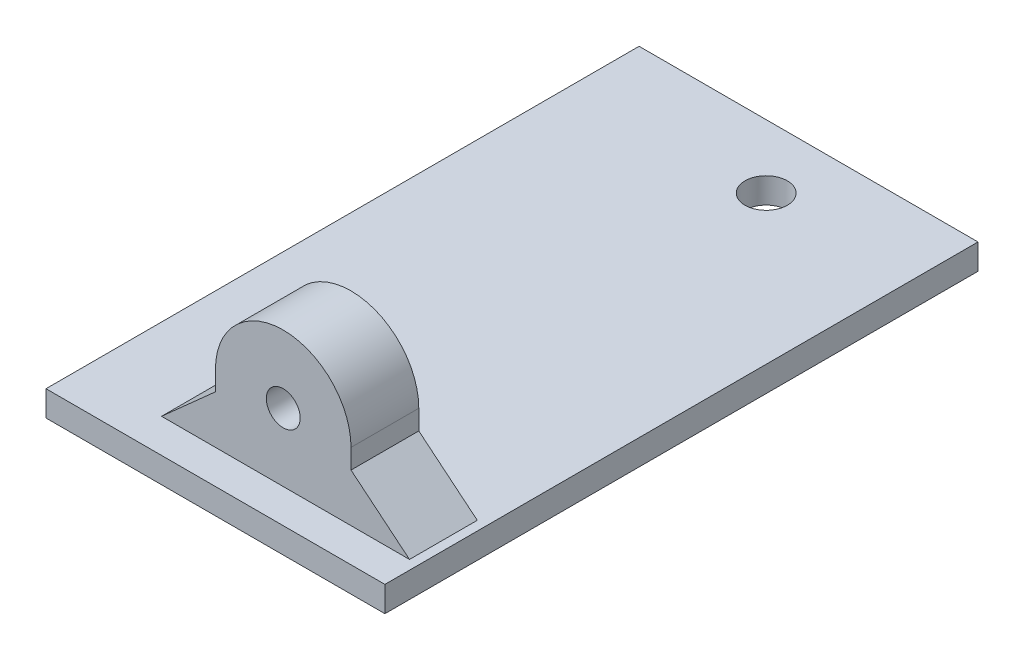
from build123d import *

# Parameters (mm, degrees)
SKETCH1_W           = 80
SKETCH1_H           = 60
BOSS_EXTRUDE1_DEPTH = 3
CUT_EXTRUDE1_DEPTH  = 10
SKETCH9_W           = 16
SKETCH9_H           = 8
BOSS_EXTRUDE3_DEPTH = 50
CUT_EXTRUDE3_DEPTH  = 50
SKETCH11_W          = 16
SKETCH11_H          = 8
BOSS_EXTRUDE4_DEPTH = 16
SKETCH12_R          = 2
CUT_EXTRUDE4_DEPTH  = 16
SKETCH14_R          = 1
SKETCH14_W          = 12.3
SKETCH14_H          = 22.8
CUT_EXTRUDE5_DEPTH  = 10
SKETCH15_R          = 2.5
CUT_EXTRUDE6_DEPTH  = 10
BOSS_EXTRUDE6_DEPTH = 10
BOSS_EXTRUDE7_DEPTH = 8
SKETCH21_W          = 81.762893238
SKETCH21_H          = 66.08233837
CUT_EXTRUDE7_DEPTH  = 40


with BuildPart() as part:
    # Sketch1 → Boss-Extrude1 (new body)
    with BuildSketch(Plane(origin=(0, 0, 0), x_dir=(1, 0, 0), z_dir=(0, 1, 0))):
        Rectangle(SKETCH1_W, SKETCH1_H)
    extrude(amount=BOSS_EXTRUDE1_DEPTH)

    # Sketch3 → Cut-Extrude1 (cut)
    with BuildSketch(Plane(origin=(0, 3, 0), x_dir=(1, 0, 0), z_dir=(0, 1, 0))):
        with BuildLine():
            ThreePointArc((-24, 22.5), (-28.267766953, 24.267766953), (-26.5, 20))
            Line((-26.5, 20), (-26.5, 22.5))
            Line((-26.5, 22.5), (-24, 22.5))
        make_face()
        with BuildLine():
            Line((-26.5, 22.5), (-26.5, 20))
            ThreePointArc((-26.5, 20), (-24.732233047, 20.732233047), (-24, 22.5))
            Line((-24, 22.5), (-26.5, 22.5))
        make_face()
        with BuildLine():
            ThreePointArc((-24, 22.5), (-28.267766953, 24.267766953), (-26.5, 20))
            Line((-26.5, 20), (-26.5, 22.5))
            Line((-26.5, 22.5), (-24, 22.5))
        make_face()
        with BuildLine():
            Line((-26.5, 22.5), (-26.5, 20))
            ThreePointArc((-26.5, 20), (-24.732233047, 20.732233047), (-24, 22.5))
            Line((-24, 22.5), (-26.5, 22.5))
        make_face()
        with BuildLine():
            ThreePointArc((20, 22.5), (20.732233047, 20.732233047), (22.5, 20))
            Line((22.5, 20), (22.5, 22.5))
            Line((22.5, 22.5), (20, 22.5))
        make_face()
        with BuildLine():
            Line((22.5, 22.5), (22.5, 20))
            ThreePointArc((22.5, 20), (24.267766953, 20.732233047), (25, 22.5))
            ThreePointArc((25, 22.5), (22.5, 25), (20, 22.5))
            Line((20, 22.5), (22.5, 22.5))
        make_face()
        with BuildLine():
            ThreePointArc((20, 22.5), (20.732233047, 20.732233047), (22.5, 20))
            Line((22.5, 20), (22.5, 22.5))
            Line((22.5, 22.5), (20, 22.5))
        make_face()
        with BuildLine():
            Line((22.5, 22.5), (22.5, 20))
            ThreePointArc((22.5, 20), (24.267766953, 20.732233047), (25, 22.5))
            ThreePointArc((25, 22.5), (22.5, 25), (20, 22.5))
            Line((20, 22.5), (22.5, 22.5))
        make_face()
        with BuildLine():
            ThreePointArc((22.5, -20), (20.732233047, -20.732233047), (20, -22.5))
            Line((20, -22.5), (22.5, -22.5))
            Line((22.5, -22.5), (22.5, -20))
        make_face()
        with BuildLine():
            Line((22.5, -22.5), (20, -22.5))
            ThreePointArc((20, -22.5), (22.5, -25), (25, -22.5))
            ThreePointArc((25, -22.5), (24.267766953, -20.732233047), (22.5, -20))
            Line((22.5, -20), (22.5, -22.5))
        make_face()
        with BuildLine():
            ThreePointArc((22.5, -20), (20.732233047, -20.732233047), (20, -22.5))
            Line((20, -22.5), (22.5, -22.5))
            Line((22.5, -22.5), (22.5, -20))
        make_face()
        with BuildLine():
            Line((22.5, -22.5), (20, -22.5))
            ThreePointArc((20, -22.5), (22.5, -25), (25, -22.5))
            ThreePointArc((25, -22.5), (24.267766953, -20.732233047), (22.5, -20))
            Line((22.5, -20), (22.5, -22.5))
        make_face()
        with BuildLine():
            Line((-26.5, -20), (-26.5, -22.5))
            Line((-26.5, -22.5), (-24, -22.5))
            ThreePointArc((-24, -22.5), (-24.732233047, -20.732233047), (-26.5, -20))
        make_face()
        with BuildLine():
            Line((-24, -22.5), (-26.5, -22.5))
            Line((-26.5, -22.5), (-26.5, -20))
            ThreePointArc((-26.5, -20), (-28.267766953, -24.267766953), (-24, -22.5))
        make_face()
        with BuildLine():
            Line((-26.5, -20), (-26.5, -22.5))
            Line((-26.5, -22.5), (-24, -22.5))
            ThreePointArc((-24, -22.5), (-24.732233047, -20.732233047), (-26.5, -20))
        make_face()
        with BuildLine():
            Line((-24, -22.5), (-26.5, -22.5))
            Line((-26.5, -22.5), (-26.5, -20))
            ThreePointArc((-26.5, -20), (-28.267766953, -24.267766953), (-24, -22.5))
        make_face()
    extrude(amount=-CUT_EXTRUDE1_DEPTH, mode=Mode.SUBTRACT)

    # Sketch9 → Boss-Extrude3 (add)
    with BuildSketch(Plane(origin=(0, 3, 0), x_dir=(1, 0, 0), z_dir=(0, 1, 0))):
        with Locations((-25, 4.257787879)):
            Rectangle(SKETCH9_W, SKETCH9_H)
    extrude(amount=BOSS_EXTRUDE3_DEPTH)

    # Sketch10 → Cut-Extrude3 (cut)
    with BuildSketch(Plane.XY.offset(-0.257787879)):
        with BuildLine():
            Line((-33, 53), (-33, 45))
            ThreePointArc((-33, 45), (-30.656854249, 50.656854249), (-25, 53))
            Line((-25, 53), (-33, 53))
        make_face()
        with BuildLine():
            ThreePointArc((-25, 53), (-19.343145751, 50.656854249), (-17, 45))
            Line((-17, 45), (-17, 53))
            Line((-17, 53), (-25, 53))
        make_face()
    extrude(amount=-CUT_EXTRUDE3_DEPTH, mode=Mode.SUBTRACT)

    # Sketch11 → Boss-Extrude4 (add)
    with BuildSketch(Plane(origin=(0, 3, 0), x_dir=(1, 0, 0), z_dir=(0, 1, 0))):
        with Locations((24, -32)):
            Rectangle(SKETCH11_W, SKETCH11_H)
    extrude(amount=BOSS_EXTRUDE4_DEPTH)

    # Sketch12 → Cut-Extrude4 (cut)
    with BuildSketch(Plane.XY.offset(36)):
        with BuildLine():
            ThreePointArc((24, 19), (29.656854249, 16.656854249), (32, 11))
            Line((32, 11), (32, 19))
            Line((32, 19), (24, 19))
        make_face()
        with BuildLine():
            Line((16, 19), (16, 11))
            ThreePointArc((16, 11), (18.343145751, 16.656854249), (24, 19))
            Line((24, 19), (16, 19))
        make_face()
        with Locations((24, 11)):
            Circle(SKETCH12_R)
    extrude(amount=-CUT_EXTRUDE4_DEPTH, mode=Mode.SUBTRACT)


with BuildPart() as body_2:
    # Split1: the piece on the far side of the plane
    add(part.part)
    split(bisect_by=Plane(origin=(0, 0, 0), x_dir=(0, 0, 1), z_dir=(1, 0, 0)), keep=Keep.BOTTOM)


with BuildPart() as part_1:
    add(part.part)

    # Split1
    split(bisect_by=Plane(origin=(0, 0, 0), x_dir=(0, 0, 1), z_dir=(1, 0, 0)), keep=Keep.TOP)

    # Sketch17 → Boss-Extrude6 (add)
    with BuildSketch(Plane.XY.offset(30)):
        Polygon((16, 3), (0, 3), (0, 0), (40, 0), (40, 3), (32, 3), align=None)
    extrude(amount=BOSS_EXTRUDE6_DEPTH)

    # Sketch18 → Boss-Extrude7 (add)
    with BuildSketch(Plane.XY.offset(36)):
        Polygon((16, 3), (16, 8.682027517), (9.638057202, 3), align=None)
        Polygon((32, 8.682027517), (38.901176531, 3), (32, 3), align=None)
    extrude(amount=-BOSS_EXTRUDE7_DEPTH)


with BuildPart() as body_2_1:
    # Body-Move_Copy1: moved
    add(body_2.part.moved(Location((-47.17, 0, 0))))

    # Sketch14 → Cut-Extrude5 (cut)
    with BuildSketch(Plane.XY.offset(-0.257787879)):
        with Locations((-72.26022554, 20.77958367)):
            Circle(SKETCH14_R)
        with Locations((-72.26022554, 49.27958367)):
            Circle(SKETCH14_R)
        with Locations((-72.26022554, 35.02958367)):
            Rectangle(SKETCH14_W, SKETCH14_H)
    extrude(amount=-CUT_EXTRUDE5_DEPTH, mode=Mode.SUBTRACT)

    # Sketch15 → Cut-Extrude6 (cut)
    with BuildSketch(Plane(origin=(0, 3, 0), x_dir=(1, 0, 0), z_dir=(0, 1, 0))):
        with Locations(Location((-54.67, -22.5, 0), (0, 0, 270))):
            Circle(SKETCH15_R)
        with Locations(Location((-54.67, 22.5, 0), (0, 0, 270))):
            Circle(SKETCH15_R)
    extrude(amount=-CUT_EXTRUDE6_DEPTH, mode=Mode.SUBTRACT)

    # Sketch21 → Cut-Extrude7 (cut, symmetric)
    with BuildSketch(Plane.XY):
        with Locations((-69.106610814, 24.81994055)):
            Rectangle(SKETCH21_W, SKETCH21_H)
    extrude(amount=CUT_EXTRUDE7_DEPTH, both=True, mode=Mode.SUBTRACT)


solid = part_1.part
